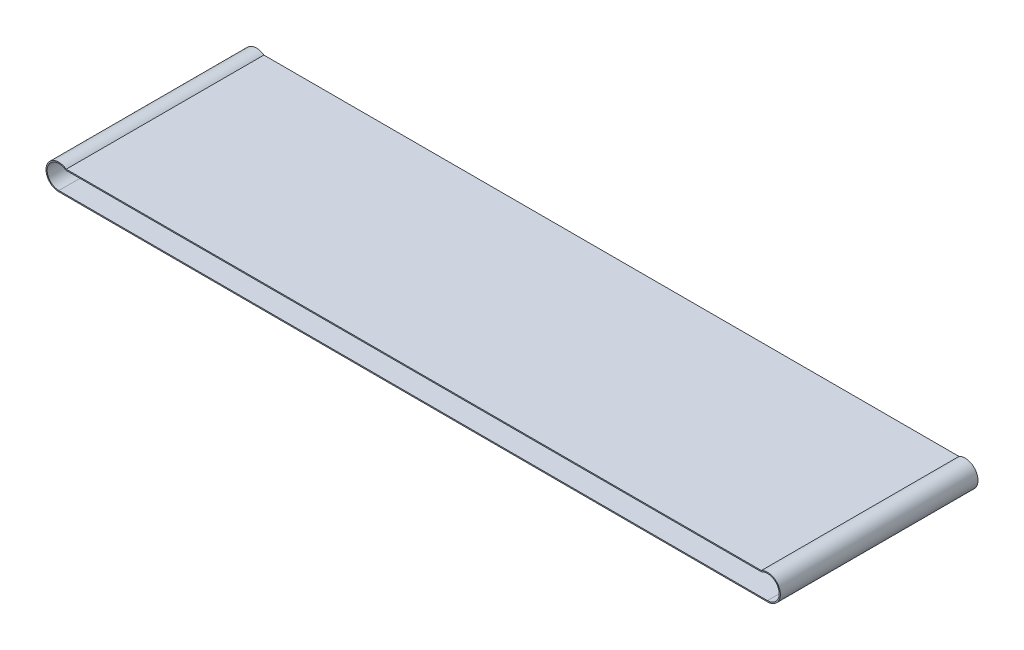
from build123d import *

# Parameters (mm, degrees)
EXTRU_MINCE1_DEPTH = 175


with BuildPart() as part:
    # Esquisse1 → Extru.-Mince1 (new, symmetric)
    with BuildSketch(Plane.XY):
        with BuildLine():
            Line((51.117398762, 63.25), (1282.157375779, 63.25))
            ThreePointArc((1282.157375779, 63.25), (1315.054928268, 48.830559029), (1292.974405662, 20.500014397))
            Line((1292.974405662, 20.500014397), (37.975199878, 21.911921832))
            ThreePointArc((37.975199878, 21.911921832), (16.320092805, 51.554634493), (51.117398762, 63.25))
        make_face()
        with BuildLine():
            Line((50.466654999, 61.25), (1282.677088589, 61.25))
            ThreePointArc((1282.677088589, 61.25), (1313.053718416, 48.580185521), (1292.976655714, 22.500013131))
            Line((1292.976655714, 22.500013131), (37.97744993, 23.911920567))
            ThreePointArc((37.97744993, 23.911920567), (18.322453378, 51.244110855), (50.466654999, 61.25))
        make_face(mode=Mode.SUBTRACT)
    extrude(amount=EXTRU_MINCE1_DEPTH, both=True)


solid = part.part
